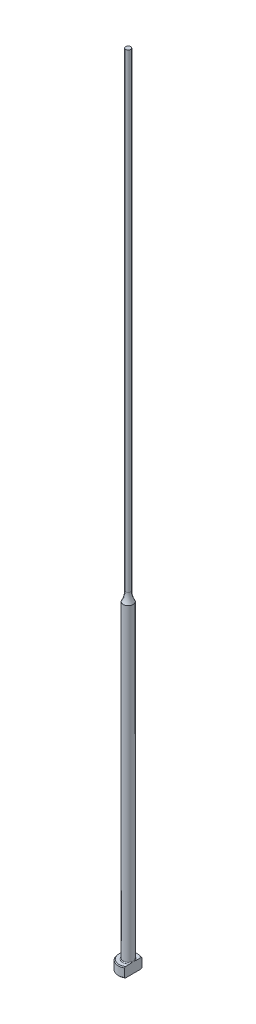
ISO-10303-21;
HEADER;
FILE_DESCRIPTION(('STEP AP214'),'2;1');
FILE_NAME('part.step','',(''),(''),'','','');
FILE_SCHEMA(('AUTOMOTIVE_DESIGN { 1 0 10303 214 1 1 1 1 }'));
ENDSEC;
DATA;
#1=APPLICATION_CONTEXT('core data for automotive mechanical design processes');
#2=APPLICATION_PROTOCOL_DEFINITION('international standard','automotive_design',2000,#1);
#3=PRODUCT_CONTEXT('',#1,'mechanical');
#4=PRODUCT('Part','Part','',(#3));
#5=PRODUCT_RELATED_PRODUCT_CATEGORY('part','',(#4));
#6=PRODUCT_DEFINITION_FORMATION('','',#4);
#7=PRODUCT_DEFINITION_CONTEXT('part definition',#1,'design');
#8=PRODUCT_DEFINITION('design','',#6,#7);
#9=PRODUCT_DEFINITION_SHAPE('','',#8);
#10=(LENGTH_UNIT() NAMED_UNIT(*) SI_UNIT(.MILLI.,.METRE.));
#11=(NAMED_UNIT(*) PLANE_ANGLE_UNIT() SI_UNIT($,.RADIAN.));
#12=(NAMED_UNIT(*) SI_UNIT($,.STERADIAN.) SOLID_ANGLE_UNIT());
#13=UNCERTAINTY_MEASURE_WITH_UNIT(LENGTH_MEASURE(1.E-05),#10,'distance_accuracy_value','');
#14=(GEOMETRIC_REPRESENTATION_CONTEXT(3) GLOBAL_UNCERTAINTY_ASSIGNED_CONTEXT((#13)) GLOBAL_UNIT_ASSIGNED_CONTEXT((#10,
#11,#12)) REPRESENTATION_CONTEXT('',''));
#15=CARTESIAN_POINT('',(0.,0.,0.));
#16=DIRECTION('',(0.,0.,1.));
#17=DIRECTION('',(1.,0.,0.));
#18=AXIS2_PLACEMENT_3D('',#15,#16,#17);
#19=CARTESIAN_POINT('',(-3.17499999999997,3.175,0.));
#20=DIRECTION('',(0.,1.,0.));
#21=DIRECTION('',(0.,0.,1.));
#22=AXIS2_PLACEMENT_3D('',#19,#20,#21);
#23=PLANE('',#22);
#24=CARTESIAN_POINT('',(0.,3.175,0.));
#25=DIRECTION('',(0.,1.,0.));
#26=DIRECTION('',(0.,0.,1.));
#27=AXIS2_PLACEMENT_3D('',#24,#25,#26);
#28=CIRCLE('',#27,2.92099999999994);
#29=CARTESIAN_POINT('',(1.58749999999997,3.175,-2.45195529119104));
#30=VERTEX_POINT('',#29);
#31=CARTESIAN_POINT('',(1.58749999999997,3.175,2.45195529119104));
#32=VERTEX_POINT('',#31);
#33=EDGE_CURVE('E105',#30,#32,#28,.T.);
#34=ORIENTED_EDGE('',*,*,#33,.T.);
#35=DIRECTION('',(0.,0.,1.));
#36=VECTOR('',#35,1.);
#37=CARTESIAN_POINT('',(1.58749999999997,3.17499999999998,2.74963065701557));
#38=LINE('',#37,#36);
#39=CARTESIAN_POINT('',(1.58749999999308,3.175,0.933255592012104));
#40=VERTEX_POINT('',#39);
#41=EDGE_CURVE('E126',#40,#32,#38,.T.);
#42=ORIENTED_EDGE('',*,*,#41,.F.);
#43=CARTESIAN_POINT('',(0.,3.175,0.));
#44=DIRECTION('',(0.,1.,0.));
#45=DIRECTION('',(0.,0.,1.));
#46=AXIS2_PLACEMENT_3D('',#43,#44,#45);
#47=CIRCLE('',#46,1.84149999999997);
#48=CARTESIAN_POINT('',(1.58749999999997,3.17500000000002,-0.933255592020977));
#49=VERTEX_POINT('',#48);
#50=EDGE_CURVE('E11',#40,#49,#47,.F.);
#51=ORIENTED_EDGE('',*,*,#50,.T.);
#52=EDGE_CURVE('E52',#30,#49,#38,.T.);
#53=ORIENTED_EDGE('',*,*,#52,.F.);
#54=EDGE_LOOP('',(#34,#42,#51,#53));
#55=FACE_BOUND('',#54,.T.);
#56=ADVANCED_FACE('F32',(#55),#23,.T.);
#57=CARTESIAN_POINT('',(0.,259.958771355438,0.));
#58=DIRECTION('',(0.,1.,0.));
#59=DIRECTION('',(0.,0.,1.));
#60=AXIS2_PLACEMENT_3D('',#57,#58,#59);
#61=CYLINDRICAL_SURFACE('',#60,3.17499999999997);
#62=CARTESIAN_POINT('',(0.,2.92100000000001,0.));
#63=DIRECTION('',(0.,1.,0.));
#64=DIRECTION('',(0.,0.,1.));
#65=AXIS2_PLACEMENT_3D('',#62,#63,#64);
#66=CIRCLE('',#65,3.17499999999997);
#67=CARTESIAN_POINT('',(1.58749999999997,2.92100000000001,2.74963065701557));
#68=VERTEX_POINT('',#67);
#69=CARTESIAN_POINT('',(1.58749999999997,2.92100000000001,-2.74963065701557));
#70=VERTEX_POINT('',#69);
#71=EDGE_CURVE('E98',#68,#70,#66,.F.);
#72=ORIENTED_EDGE('',*,*,#71,.T.);
#73=DIRECTION('',(0.,-1.,0.));
#74=VECTOR('',#73,1.);
#75=CARTESIAN_POINT('',(1.58749999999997,254.001,-2.74963065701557));
#76=LINE('',#75,#74);
#77=CARTESIAN_POINT('',(1.58749999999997,0.253999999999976,-2.74963065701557));
#78=VERTEX_POINT('',#77);
#79=EDGE_CURVE('E141',#70,#78,#76,.T.);
#80=ORIENTED_EDGE('',*,*,#79,.T.);
#81=CARTESIAN_POINT('',(0.,0.253999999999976,0.));
#82=DIRECTION('',(0.,-1.,0.));
#83=DIRECTION('',(0.,0.,-1.));
#84=AXIS2_PLACEMENT_3D('',#81,#82,#83);
#85=CIRCLE('',#84,3.17499999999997);
#86=CARTESIAN_POINT('',(1.58749999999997,0.253999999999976,2.74963065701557));
#87=VERTEX_POINT('',#86);
#88=EDGE_CURVE('E95',#78,#87,#85,.F.);
#89=ORIENTED_EDGE('',*,*,#88,.T.);
#90=DIRECTION('',(0.,-1.,0.));
#91=VECTOR('',#90,1.);
#92=CARTESIAN_POINT('',(1.58749999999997,254.001,2.74963065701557));
#93=LINE('',#92,#91);
#94=EDGE_CURVE('E88',#68,#87,#93,.T.);
#95=ORIENTED_EDGE('',*,*,#94,.F.);
#96=EDGE_LOOP('',(#72,#80,#89,#95));
#97=FACE_BOUND('',#96,.T.);
#98=ADVANCED_FACE('F191',(#97),#61,.T.);
#99=CARTESIAN_POINT('',(0.,0.,0.));
#100=DIRECTION('',(0.,-1.,0.));
#101=DIRECTION('',(0.,0.,-1.));
#102=AXIS2_PLACEMENT_3D('',#99,#100,#101);
#103=PLANE('',#102);
#104=CARTESIAN_POINT('',(0.,0.,0.));
#105=DIRECTION('',(0.,-1.,0.));
#106=DIRECTION('',(0.,0.,-1.));
#107=AXIS2_PLACEMENT_3D('',#104,#105,#106);
#108=CIRCLE('',#107,2.92100000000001);
#109=CARTESIAN_POINT('',(1.58749999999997,0.,2.45195529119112));
#110=VERTEX_POINT('',#109);
#111=CARTESIAN_POINT('',(1.58749999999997,0.,-2.45195529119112));
#112=VERTEX_POINT('',#111);
#113=EDGE_CURVE('E93',#110,#112,#108,.T.);
#114=ORIENTED_EDGE('',*,*,#113,.T.);
#115=DIRECTION('',(0.,0.,1.));
#116=VECTOR('',#115,1.);
#117=CARTESIAN_POINT('',(1.58749999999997,0.,2.74963065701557));
#118=LINE('',#117,#116);
#119=EDGE_CURVE('E78',#112,#110,#118,.T.);
#120=ORIENTED_EDGE('',*,*,#119,.T.);
#121=EDGE_LOOP('',(#114,#120));
#122=FACE_BOUND('',#121,.T.);
#123=ADVANCED_FACE('F97',(#122),#103,.T.);
#124=CARTESIAN_POINT('',(0.,3.17499999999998,0.));
#125=DIRECTION('',(0.,-1.,0.));
#126=DIRECTION('',(0.,0.,-1.));
#127=AXIS2_PLACEMENT_3D('',#124,#125,#126);
#128=CONICAL_SURFACE('',#127,2.92099999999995,0.785398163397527);
#129=ORIENTED_EDGE('',*,*,#71,.F.);
#130=CARTESIAN_POINT('',(1.58749999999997,-0.16162066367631,-6.0529050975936));
#131=CARTESIAN_POINT('',(1.58749999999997,-0.0288893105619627,-5.91567682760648));
#132=CARTESIAN_POINT('',(1.58749999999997,0.103699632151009,-5.7783103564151));
#133=CARTESIAN_POINT('',(1.58749999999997,0.368508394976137,-5.50321874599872));
#134=CARTESIAN_POINT('',(1.58749999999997,0.500728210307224,-5.36549360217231));
#135=CARTESIAN_POINT('',(1.58749999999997,0.764778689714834,-5.08953516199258));
#136=CARTESIAN_POINT('',(1.58749999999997,0.896609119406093,-4.9513016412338));
#137=CARTESIAN_POINT('',(1.58749999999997,1.15968706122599,-4.67428233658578));
#138=CARTESIAN_POINT('',(1.58749999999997,1.29093457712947,-4.53549655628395));
#139=CARTESIAN_POINT('',(1.58749999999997,1.55007705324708,-4.25997724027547));
#140=CARTESIAN_POINT('',(1.58749999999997,1.67798684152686,-4.12325766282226));
#141=CARTESIAN_POINT('',(1.58749999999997,1.9328486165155,-3.84892898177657));
#142=CARTESIAN_POINT('',(1.58749999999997,2.05980060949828,-3.71131988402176));
#143=CARTESIAN_POINT('',(1.58749999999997,2.31237508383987,-3.43493978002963));
#144=CARTESIAN_POINT('',(1.58749999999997,2.43799784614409,-3.29616903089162));
#145=CARTESIAN_POINT('',(1.58749999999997,2.68741369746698,-3.01699558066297));
#146=CARTESIAN_POINT('',(1.58749999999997,2.81120686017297,-2.8765929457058));
#147=CARTESIAN_POINT('',(1.58749999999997,3.00875865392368,-2.64816703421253));
#148=CARTESIAN_POINT('',(1.58749999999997,3.08336151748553,-2.56087478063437));
#149=CARTESIAN_POINT('',(1.58749999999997,3.2312387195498,-2.38515423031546));
#150=CARTESIAN_POINT('',(1.58749999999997,3.30451292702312,-2.29672582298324));
#151=CARTESIAN_POINT('',(1.58749999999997,3.45004422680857,-2.1174740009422));
#152=CARTESIAN_POINT('',(1.58749999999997,3.5222823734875,-2.02663514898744));
#153=CARTESIAN_POINT('',(1.58749999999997,3.66423097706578,-1.8430252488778));
#154=CARTESIAN_POINT('',(1.58749999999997,3.73394203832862,-1.75025467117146));
#155=CARTESIAN_POINT('',(1.58749999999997,3.87080633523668,-1.5606747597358));
#156=CARTESIAN_POINT('',(1.58749999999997,3.93790459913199,-1.46382547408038));
#157=CARTESIAN_POINT('',(1.58749999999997,4.06669147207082,-1.26632594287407));
#158=CARTESIAN_POINT('',(1.58749999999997,4.1283726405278,-1.16567073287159));
#159=CARTESIAN_POINT('',(1.58749999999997,4.21402252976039,-1.01165766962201));
#160=CARTESIAN_POINT('',(1.58749999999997,4.24127929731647,-0.960142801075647));
#161=CARTESIAN_POINT('',(1.58749999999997,4.2930979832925,-0.855780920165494));
#162=CARTESIAN_POINT('',(1.58749999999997,4.31765941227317,-0.802933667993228));
#163=CARTESIAN_POINT('',(1.58749999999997,4.38614656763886,-0.642461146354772));
#164=CARTESIAN_POINT('',(1.58749999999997,4.42510149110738,-0.532518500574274));
#165=CARTESIAN_POINT('',(1.58749999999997,4.46726244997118,-0.367680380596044));
#166=CARTESIAN_POINT('',(1.58749999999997,4.47844427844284,-0.314802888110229));
#167=CARTESIAN_POINT('',(1.58749999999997,4.49576654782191,-0.208209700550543));
#168=CARTESIAN_POINT('',(1.58749999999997,4.50190743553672,-0.154494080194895));
#169=CARTESIAN_POINT('',(1.58749999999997,4.50871296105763,-0.0468792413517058));
#170=CARTESIAN_POINT('',(1.58749999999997,4.5093945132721,0.00701889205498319));
#171=CARTESIAN_POINT('',(1.58749999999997,4.50527679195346,0.114606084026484));
#172=CARTESIAN_POINT('',(1.58749999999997,4.50047706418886,0.168295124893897));
#173=CARTESIAN_POINT('',(1.58749999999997,4.48579689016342,0.27448544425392));
#174=CARTESIAN_POINT('',(1.58749999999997,4.47596081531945,0.32699298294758));
#175=CARTESIAN_POINT('',(1.58749999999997,4.45181809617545,0.430974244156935));
#176=CARTESIAN_POINT('',(1.58749999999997,4.4375096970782,0.482447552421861));
#177=CARTESIAN_POINT('',(1.58749999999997,4.40502489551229,0.584460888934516));
#178=CARTESIAN_POINT('',(1.58749999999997,4.386827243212,0.634994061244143));
#179=CARTESIAN_POINT('',(1.58749999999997,4.34729308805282,0.734789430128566));
#180=CARTESIAN_POINT('',(1.58749999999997,4.3259572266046,0.784051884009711));
#181=CARTESIAN_POINT('',(1.58749999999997,4.25791922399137,0.930549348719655));
#182=CARTESIAN_POINT('',(1.58749999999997,4.20736047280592,1.0259880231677));
#183=CARTESIAN_POINT('',(1.58749999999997,4.0995545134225,1.21304313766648));
#184=CARTESIAN_POINT('',(1.58749999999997,4.04229912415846,1.30465471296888));
#185=CARTESIAN_POINT('',(1.58749999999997,3.92308746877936,1.48526211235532));
#186=CARTESIAN_POINT('',(1.58749999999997,3.86111349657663,1.57424615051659));
#187=CARTESIAN_POINT('',(1.58749999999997,3.73408621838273,1.74990003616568));
#188=CARTESIAN_POINT('',(1.58749999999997,3.66903444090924,1.83657099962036));
#189=CARTESIAN_POINT('',(1.58749999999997,3.53583371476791,2.00931764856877));
#190=CARTESIAN_POINT('',(1.58749999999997,3.46765527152,2.09537048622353));
#191=CARTESIAN_POINT('',(1.58749999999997,3.32960643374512,2.26611736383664));
#192=CARTESIAN_POINT('',(1.58749999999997,3.25973586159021,2.35081125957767));
#193=CARTESIAN_POINT('',(1.58749999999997,3.04858139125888,2.60290121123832));
#194=CARTESIAN_POINT('',(1.58749999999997,2.90542388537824,2.76872537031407));
#195=CARTESIAN_POINT('',(1.58749999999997,2.64069522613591,3.06970913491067));
#196=CARTESIAN_POINT('',(1.58749999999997,2.51959458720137,3.20528660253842));
#197=CARTESIAN_POINT('',(1.58749999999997,2.27590400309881,3.47510321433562));
#198=CARTESIAN_POINT('',(1.58749999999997,2.15331401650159,3.60934232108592));
#199=CARTESIAN_POINT('',(1.58749999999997,1.90694239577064,3.87695374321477));
#200=CARTESIAN_POINT('',(1.58749999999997,1.78315974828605,4.0103251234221));
#201=CARTESIAN_POINT('',(1.58749999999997,1.53478104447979,4.27630880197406));
#202=CARTESIAN_POINT('',(1.58749999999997,1.41018498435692,4.40892109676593));
#203=CARTESIAN_POINT('',(1.58749999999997,1.0457468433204,4.79499418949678));
#204=CARTESIAN_POINT('',(1.58749999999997,0.80507680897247,5.04767313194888));
#205=CARTESIAN_POINT('',(1.58749999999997,0.443121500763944,5.42550911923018));
#206=CARTESIAN_POINT('',(1.58749999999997,0.322378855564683,5.55118772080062));
#207=CARTESIAN_POINT('',(1.58749999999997,0.0805914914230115,5.80225207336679));
#208=CARTESIAN_POINT('',(1.58749999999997,-0.040453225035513,5.92763782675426));
#209=CARTESIAN_POINT('',(1.58749999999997,-0.161620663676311,6.0529050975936));
#210=B_SPLINE_CURVE_WITH_KNOTS('',3,(#130,#131,#132,#133,#134,#135,#136,#137,#138,#139,#140,
#141,#142,#143,#144,#145,#146,#147,#148,#149,#150,#151,#152,#153,#154,#155,#156,#157,#158,#159,
#160,#161,#162,#163,#164,#165,#166,#167,#168,#169,#170,#171,#172,#173,#174,#175,#176,#177,#178,
#179,#180,#181,#182,#183,#184,#185,#186,#187,#188,#189,#190,#191,#192,#193,#194,#195,#196,#197,
#198,#199,#200,#201,#202,#203,#204,#205,#206,#207,#208,#209),.UNSPECIFIED.,.F.,.F.,(4,2,2,2,2,2,
2,2,2,2,2,2,2,2,2,2,2,2,2,2,2,2,2,2,2,2,2,2,2,2,2,2,2,2,2,2,2,2,2,4),(0.,0.572750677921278,
1.14550874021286,1.71856057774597,2.29160869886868,2.85328006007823,3.4149477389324,
3.97649423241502,4.53801804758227,4.88249307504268,5.22700189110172,5.5751532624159,
5.92322081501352,6.27657800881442,6.63041319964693,6.80518126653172,6.9799810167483,
7.3282426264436,7.49018491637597,7.65211285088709,7.81353889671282,7.97497832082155,
8.13501929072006,8.29512313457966,8.45612518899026,8.61709438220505,8.94062993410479,
9.2645649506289,9.58978187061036,9.91483894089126,10.2441741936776,10.5735441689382,
11.2306812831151,11.7760337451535,12.3214014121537,12.8672825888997,13.4131663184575,
14.4600164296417,14.9828595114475,15.5056983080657),.UNSPECIFIED.);
#211=EDGE_CURVE('E118',#32,#68,#210,.T.);
#212=ORIENTED_EDGE('',*,*,#211,.F.);
#213=ORIENTED_EDGE('',*,*,#33,.F.);
#214=EDGE_CURVE('E117',#70,#30,#210,.T.);
#215=ORIENTED_EDGE('',*,*,#214,.F.);
#216=EDGE_LOOP('',(#129,#212,#213,#215));
#217=FACE_BOUND('',#216,.T.);
#218=ADVANCED_FACE('F162',(#217),#128,.T.);
#219=CARTESIAN_POINT('',(0.,0.253999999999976,0.));
#220=DIRECTION('',(0.,1.,0.));
#221=DIRECTION('',(0.,0.,1.));
#222=AXIS2_PLACEMENT_3D('',#219,#220,#221);
#223=CONICAL_SURFACE('',#222,3.17499999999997,0.785398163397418);
#224=ORIENTED_EDGE('',*,*,#88,.F.);
#225=CARTESIAN_POINT('',(1.58749999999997,3.33662066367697,6.0529050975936));
#226=CARTESIAN_POINT('',(1.58749999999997,3.20388931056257,5.91567682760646));
#227=CARTESIAN_POINT('',(1.58749999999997,3.07130036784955,5.77831035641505));
#228=CARTESIAN_POINT('',(1.58749999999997,2.80649160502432,5.50321874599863));
#229=CARTESIAN_POINT('',(1.58749999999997,2.67427178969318,5.3654936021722));
#230=CARTESIAN_POINT('',(1.58749999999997,2.41022131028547,5.08953516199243));
#231=CARTESIAN_POINT('',(1.58749999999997,2.27839088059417,4.95130164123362));
#232=CARTESIAN_POINT('',(1.58749999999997,2.01531293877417,4.67428233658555));
#233=CARTESIAN_POINT('',(1.58749999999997,1.88406542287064,4.5354965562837));
#234=CARTESIAN_POINT('',(1.58749999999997,1.62492294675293,4.25997724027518));
#235=CARTESIAN_POINT('',(1.58749999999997,1.49701315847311,4.12325766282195));
#236=CARTESIAN_POINT('',(1.58749999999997,1.24215138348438,3.84892898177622));
#237=CARTESIAN_POINT('',(1.58749999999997,1.11519939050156,3.71131988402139));
#238=CARTESIAN_POINT('',(1.58749999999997,0.862624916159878,3.43493978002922));
#239=CARTESIAN_POINT('',(1.58749999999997,0.737002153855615,3.29616903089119));
#240=CARTESIAN_POINT('',(1.58749999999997,0.487586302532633,3.01699558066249));
#241=CARTESIAN_POINT('',(1.58749999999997,0.363793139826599,2.8765929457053));
#242=CARTESIAN_POINT('',(1.58749999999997,0.166241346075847,2.64816703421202));
#243=CARTESIAN_POINT('',(1.58749999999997,0.0916384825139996,2.56087478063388));
#244=CARTESIAN_POINT('',(1.58749999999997,-0.0562387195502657,2.385154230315));
#245=CARTESIAN_POINT('',(1.58749999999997,-0.129512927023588,2.29672582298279));
#246=CARTESIAN_POINT('',(1.58749999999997,-0.27504422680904,2.11747400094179));
#247=CARTESIAN_POINT('',(1.58749999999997,-0.347282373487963,2.02663514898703));
#248=CARTESIAN_POINT('',(1.58749999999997,-0.489230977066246,1.84302524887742));
#249=CARTESIAN_POINT('',(1.58749999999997,-0.558942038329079,1.7502546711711));
#250=CARTESIAN_POINT('',(1.58749999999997,-0.695806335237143,1.56067475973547));
#251=CARTESIAN_POINT('',(1.58749999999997,-0.762904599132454,1.46382547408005));
#252=CARTESIAN_POINT('',(1.58749999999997,-0.891691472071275,1.26632594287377));
#253=CARTESIAN_POINT('',(1.58749999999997,-0.953372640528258,1.16567073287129));
#254=CARTESIAN_POINT('',(1.58749999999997,-1.03902252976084,1.01165766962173));
#255=CARTESIAN_POINT('',(1.58749999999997,-1.06627929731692,0.960142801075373));
#256=CARTESIAN_POINT('',(1.58749999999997,-1.11809798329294,0.85578092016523));
#257=CARTESIAN_POINT('',(1.58749999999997,-1.14265941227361,0.802933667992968));
#258=CARTESIAN_POINT('',(1.58749999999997,-1.21114656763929,0.642461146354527));
#259=CARTESIAN_POINT('',(1.58749999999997,-1.2501014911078,0.532518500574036));
#260=CARTESIAN_POINT('',(1.58749999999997,-1.29226244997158,0.367680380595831));
#261=CARTESIAN_POINT('',(1.58749999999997,-1.30344427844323,0.314802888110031));
#262=CARTESIAN_POINT('',(1.58749999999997,-1.32076654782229,0.208209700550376));
#263=CARTESIAN_POINT('',(1.58749999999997,-1.3269074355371,0.154494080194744));
#264=CARTESIAN_POINT('',(1.58749999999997,-1.333712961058,0.0468792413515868));
#265=CARTESIAN_POINT('',(1.58749999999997,-1.33439451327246,-0.00701889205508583));
#266=CARTESIAN_POINT('',(1.58749999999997,-1.33027679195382,-0.114606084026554));
#267=CARTESIAN_POINT('',(1.58749999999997,-1.32547706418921,-0.168295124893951));
#268=CARTESIAN_POINT('',(1.58749999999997,-1.31079689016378,-0.274485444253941));
#269=CARTESIAN_POINT('',(1.58749999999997,-1.3009608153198,-0.326992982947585));
#270=CARTESIAN_POINT('',(1.58749999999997,-1.27681809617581,-0.430974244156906));
#271=CARTESIAN_POINT('',(1.58749999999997,-1.26250969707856,-0.482447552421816));
#272=CARTESIAN_POINT('',(1.58749999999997,-1.23002489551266,-0.584460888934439));
#273=CARTESIAN_POINT('',(1.58749999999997,-1.21182724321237,-0.634994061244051));
#274=CARTESIAN_POINT('',(1.58749999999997,-1.1722930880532,-0.734789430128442));
#275=CARTESIAN_POINT('',(1.58749999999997,-1.15095722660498,-0.784051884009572));
#276=CARTESIAN_POINT('',(1.58749999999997,-1.08291922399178,-0.93054934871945));
#277=CARTESIAN_POINT('',(1.58749999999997,-1.03236047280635,-1.02598802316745));
#278=CARTESIAN_POINT('',(1.58749999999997,-0.924554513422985,-1.21304313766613));
#279=CARTESIAN_POINT('',(1.58749999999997,-0.86729912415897,-1.30465471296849));
#280=CARTESIAN_POINT('',(1.58749999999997,-0.748087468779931,-1.48526211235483));
#281=CARTESIAN_POINT('',(1.58749999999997,-0.686113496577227,-1.57424615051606));
#282=CARTESIAN_POINT('',(1.58749999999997,-0.55908621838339,-1.74990003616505));
#283=CARTESIAN_POINT('',(1.58749999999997,-0.494034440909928,-1.83657099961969));
#284=CARTESIAN_POINT('',(1.58749999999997,-0.360833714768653,-2.00931764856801));
#285=CARTESIAN_POINT('',(1.58749999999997,-0.292655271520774,-2.09537048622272));
#286=CARTESIAN_POINT('',(1.58749999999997,-0.154606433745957,-2.26611736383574));
#287=CARTESIAN_POINT('',(1.58749999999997,-0.0847358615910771,-2.35081125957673));
#288=CARTESIAN_POINT('',(1.58749999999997,0.126418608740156,-2.60290121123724));
#289=CARTESIAN_POINT('',(1.58749999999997,0.269576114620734,-2.76872537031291));
#290=CARTESIAN_POINT('',(1.58749999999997,0.534304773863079,-3.06970913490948));
#291=CARTESIAN_POINT('',(1.58749999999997,0.655405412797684,-3.20528660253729));
#292=CARTESIAN_POINT('',(1.58749999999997,0.899095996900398,-3.47510321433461));
#293=CARTESIAN_POINT('',(1.58749999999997,1.02168598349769,-3.60934232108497));
#294=CARTESIAN_POINT('',(1.58749999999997,1.26805760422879,-3.87695374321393));
#295=CARTESIAN_POINT('',(1.58749999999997,1.39184025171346,-4.01032512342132));
#296=CARTESIAN_POINT('',(1.58749999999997,1.64021895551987,-4.2763088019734));
#297=CARTESIAN_POINT('',(1.58749999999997,1.76481501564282,-4.40892109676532));
#298=CARTESIAN_POINT('',(1.58749999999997,2.12925315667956,-4.79499418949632));
#299=CARTESIAN_POINT('',(1.58749999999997,2.36992319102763,-5.04767313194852));
#300=CARTESIAN_POINT('',(1.58749999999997,2.73187849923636,-5.42550911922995));
#301=CARTESIAN_POINT('',(1.58749999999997,2.85262114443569,-5.55118772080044));
#302=CARTESIAN_POINT('',(1.58749999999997,3.09440850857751,-5.8022520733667));
#303=CARTESIAN_POINT('',(1.58749999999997,3.2154532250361,-5.92763782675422));
#304=CARTESIAN_POINT('',(1.58749999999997,3.33662066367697,-6.0529050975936));
#305=B_SPLINE_CURVE_WITH_KNOTS('',3,(#225,#226,#227,#228,#229,#230,#231,#232,#233,#234,#235,
#236,#237,#238,#239,#240,#241,#242,#243,#244,#245,#246,#247,#248,#249,#250,#251,#252,#253,#254,
#255,#256,#257,#258,#259,#260,#261,#262,#263,#264,#265,#266,#267,#268,#269,#270,#271,#272,#273,
#274,#275,#276,#277,#278,#279,#280,#281,#282,#283,#284,#285,#286,#287,#288,#289,#290,#291,#292,
#293,#294,#295,#296,#297,#298,#299,#300,#301,#302,#303,#304),.UNSPECIFIED.,.F.,.F.,(4,2,2,2,2,2,
2,2,2,2,2,2,2,2,2,2,2,2,2,2,2,2,2,2,2,2,2,2,2,2,2,2,2,2,2,2,2,2,2,4),(0.,0.57275067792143,
1.14550874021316,1.71856057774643,2.29160869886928,2.85328006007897,3.41494773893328,
3.97649423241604,4.53801804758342,4.88249307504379,5.2270018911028,5.57515326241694,
5.92322081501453,6.27657800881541,6.63041319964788,6.80518126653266,6.97998101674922,
7.32824262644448,7.49018491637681,7.65211285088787,7.81353889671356,7.97497832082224,
8.1350192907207,8.29512313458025,8.45612518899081,8.61709438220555,8.94062993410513,
9.26456495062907,9.58978187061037,9.91483894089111,10.2441741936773,10.5735441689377,
11.2306812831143,11.776033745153,12.3214014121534,12.8672825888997,13.4131663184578,
14.4600164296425,14.9828595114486,15.505698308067),.UNSPECIFIED.);
#306=EDGE_CURVE('E81',#112,#78,#305,.T.);
#307=ORIENTED_EDGE('',*,*,#306,.F.);
#308=ORIENTED_EDGE('',*,*,#113,.F.);
#309=EDGE_CURVE('E84',#87,#110,#305,.T.);
#310=ORIENTED_EDGE('',*,*,#309,.F.);
#311=EDGE_LOOP('',(#224,#307,#308,#310));
#312=FACE_BOUND('',#311,.T.);
#313=ADVANCED_FACE('F92',(#312),#223,.T.);
#314=CARTESIAN_POINT('',(0.,3.42900000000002,0.));
#315=DIRECTION('',(0.,1.,0.));
#316=DIRECTION('',(0.,0.,1.));
#317=AXIS2_PLACEMENT_3D('',#314,#315,#316);
#318=TOROIDAL_SURFACE('',#317,1.84149999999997,0.254);
#319=CARTESIAN_POINT('',(1.58749999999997,3.42900000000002,0.));
#320=CARTESIAN_POINT('',(1.58749999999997,3.42899942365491,-1.9220514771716E-10));
#321=CARTESIAN_POINT('',(1.58749999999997,3.42899884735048,-1.2261161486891E-07));
#322=CARTESIAN_POINT('',(1.58749999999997,3.42899773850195,-5.09676365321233E-07));
#323=CARTESIAN_POINT('',(1.58749999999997,3.42899720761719,-7.78176328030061E-07));
#324=CARTESIAN_POINT('',(1.58749999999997,3.42899614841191,-1.42307272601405E-06));
#325=CARTESIAN_POINT('',(1.58749999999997,3.42899562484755,-1.80713867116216E-06));
#326=CARTESIAN_POINT('',(1.58749999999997,3.42899463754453,-2.63494846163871E-06));
#327=CARTESIAN_POINT('',(1.58749999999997,3.42899417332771,-3.07814756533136E-06));
#328=CARTESIAN_POINT('',(1.58749999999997,3.42899261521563,-4.66897357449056E-06));
#329=CARTESIAN_POINT('',(1.58749999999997,3.42899159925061,-5.89404908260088E-06));
#330=CARTESIAN_POINT('',(1.58749999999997,3.42898979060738,-8.42427511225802E-06));
#331=CARTESIAN_POINT('',(1.58749999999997,3.42898899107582,-9.7248057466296E-06));
#332=CARTESIAN_POINT('',(1.58749999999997,3.42898598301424,-1.48060601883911E-05));
#333=CARTESIAN_POINT('',(1.58749999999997,3.42898393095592,-1.86838281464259E-05));
#334=CARTESIAN_POINT('',(1.58749999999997,3.42898057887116,-2.63261117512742E-05));
#335=CARTESIAN_POINT('',(1.58749999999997,3.42897922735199,-3.00687417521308E-05));
#336=CARTESIAN_POINT('',(1.58749999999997,3.42897347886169,-4.60276298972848E-05));
#337=CARTESIAN_POINT('',(1.58749999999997,3.42896911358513,-5.8247019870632E-05));
#338=CARTESIAN_POINT('',(1.58749999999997,3.42896211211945,-8.11070097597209E-05));
#339=CARTESIAN_POINT('',(1.58749999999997,3.42895931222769,-9.16953114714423E-05));
#340=CARTESIAN_POINT('',(1.58749999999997,3.42893712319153,-0.000168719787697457));
#341=CARTESIAN_POINT('',(1.58749999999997,3.42890881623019,-0.000232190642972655));
#342=CARTESIAN_POINT('',(1.58749999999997,3.42880276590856,-0.000479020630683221));
#343=CARTESIAN_POINT('',(1.58749999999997,3.42873165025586,-0.00066443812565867));
#344=CARTESIAN_POINT('',(1.58749999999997,3.42845137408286,-0.0013844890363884));
#345=CARTESIAN_POINT('',(1.58749999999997,3.42823526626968,-0.00191701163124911));
#346=CARTESIAN_POINT('',(1.58749999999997,3.42735449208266,-0.00409774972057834));
#347=CARTESIAN_POINT('',(1.58749999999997,3.42669768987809,-0.00574830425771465));
#348=CARTESIAN_POINT('',(1.58749999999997,3.4174405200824,-0.0289985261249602));
#349=CARTESIAN_POINT('',(1.58749999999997,3.40878325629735,-0.0505816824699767));
#350=CARTESIAN_POINT('',(1.58749999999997,3.39189297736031,-0.0929947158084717));
#351=CARTESIAN_POINT('',(1.58749999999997,3.38365605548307,-0.11382315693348));
#352=CARTESIAN_POINT('',(1.58749999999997,3.36635393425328,-0.157956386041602));
#353=CARTESIAN_POINT('',(1.58749999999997,3.35730391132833,-0.181267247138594));
#354=CARTESIAN_POINT('',(1.58749999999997,3.33936775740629,-0.228222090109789));
#355=CARTESIAN_POINT('',(1.58749999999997,3.33048420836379,-0.25186705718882));
#356=CARTESIAN_POINT('',(1.58749999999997,3.30894496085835,-0.310512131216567));
#357=CARTESIAN_POINT('',(1.58749999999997,3.29649449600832,-0.345588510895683));
#358=CARTESIAN_POINT('',(1.58749999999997,3.27296975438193,-0.415278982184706));
#359=CARTESIAN_POINT('',(1.58749999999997,3.26186987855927,-0.449884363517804));
#360=CARTESIAN_POINT('',(1.58749999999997,3.2395832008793,-0.524471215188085));
#361=CARTESIAN_POINT('',(1.58749999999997,3.22860862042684,-0.564517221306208));
#362=CARTESIAN_POINT('',(1.58749999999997,3.20902534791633,-0.645529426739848));
#363=CARTESIAN_POINT('',(1.58749999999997,3.20043582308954,-0.686500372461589));
#364=CARTESIAN_POINT('',(1.58749999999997,3.18611712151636,-0.771546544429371));
#365=CARTESIAN_POINT('',(1.58749999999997,3.18059550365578,-0.815658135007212));
#366=CARTESIAN_POINT('',(1.58749999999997,3.17455396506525,-0.904117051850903));
#367=CARTESIAN_POINT('',(1.58749999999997,3.17401361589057,-0.948462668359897));
#368=CARTESIAN_POINT('',(1.58749999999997,3.17898948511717,-1.02531896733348));
#369=CARTESIAN_POINT('',(1.58749999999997,3.1829739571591,-1.05792141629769));
#370=CARTESIAN_POINT('',(1.58749999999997,3.19569167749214,-1.12184393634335));
#371=CARTESIAN_POINT('',(1.58749999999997,3.20436049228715,-1.1531753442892));
#372=CARTESIAN_POINT('',(1.58749999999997,3.22236152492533,-1.19946468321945));
#373=CARTESIAN_POINT('',(1.58749999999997,3.2295150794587,-1.21526783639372));
#374=CARTESIAN_POINT('',(1.58749999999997,3.24587062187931,-1.24583726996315));
#375=CARTESIAN_POINT('',(1.58749999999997,3.25507530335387,-1.26060215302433));
#376=CARTESIAN_POINT('',(1.58749999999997,3.27378481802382,-1.28575815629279));
#377=CARTESIAN_POINT('',(1.58749999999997,3.28289001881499,-1.29644383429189));
#378=CARTESIAN_POINT('',(1.58749999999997,3.30268460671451,-1.31623154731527));
#379=CARTESIAN_POINT('',(1.58749999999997,3.31337067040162,-1.32533681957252));
#380=CARTESIAN_POINT('',(1.58749999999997,3.33349977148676,-1.33941140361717));
#381=CARTESIAN_POINT('',(1.58749999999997,3.34261446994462,-1.34484814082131));
#382=CARTESIAN_POINT('',(1.58749999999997,3.36161455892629,-1.35416329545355));
#383=CARTESIAN_POINT('',(1.58749999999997,3.37149946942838,-1.35804267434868));
#384=CARTESIAN_POINT('',(1.58749999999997,3.39188678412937,-1.36398436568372));
#385=CARTESIAN_POINT('',(1.58749999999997,3.40239309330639,-1.36603350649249));
#386=CARTESIAN_POINT('',(1.58749999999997,3.42360372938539,-1.3680840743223));
#387=CARTESIAN_POINT('',(1.58749999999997,3.43430795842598,-1.36808648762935));
#388=CARTESIAN_POINT('',(1.58749999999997,3.45433283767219,-1.36616208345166));
#389=CARTESIAN_POINT('',(1.58749999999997,3.46367506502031,-1.36444960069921));
#390=CARTESIAN_POINT('',(1.58749999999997,3.48195519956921,-1.35953338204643));
#391=CARTESIAN_POINT('',(1.58749999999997,3.49089304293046,-1.3563294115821));
#392=CARTESIAN_POINT('',(1.58749999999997,3.50850302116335,-1.34848006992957));
#393=CARTESIAN_POINT('',(1.58749999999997,3.5171531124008,-1.34378578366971));
#394=CARTESIAN_POINT('',(1.58749999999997,3.53371257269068,-1.33324445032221));
#395=CARTESIAN_POINT('',(1.58749999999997,3.54162163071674,-1.32739692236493));
#396=CARTESIAN_POINT('',(1.58749999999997,3.56107121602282,-1.31107304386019));
#397=CARTESIAN_POINT('',(1.58749999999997,3.57202221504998,-1.29989286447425));
#398=CARTESIAN_POINT('',(1.58749999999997,3.59202509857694,-1.27593566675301));
#399=CARTESIAN_POINT('',(1.58749999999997,3.60107086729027,-1.26315370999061));
#400=CARTESIAN_POINT('',(1.58749999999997,3.62186023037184,-1.22930733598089));
#401=CARTESIAN_POINT('',(1.58749999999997,3.63240584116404,-1.20751096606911));
#402=CARTESIAN_POINT('',(1.58749999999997,3.65004643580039,-1.16266144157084));
#403=CARTESIAN_POINT('',(1.58749999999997,3.65714435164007,-1.13960937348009));
#404=CARTESIAN_POINT('',(1.58749999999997,3.67265428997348,-1.07603916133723));
#405=CARTESIAN_POINT('',(1.58749999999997,3.67834921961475,-1.03486686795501));
#406=CARTESIAN_POINT('',(1.58749999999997,3.68382880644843,-0.951558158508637));
#407=CARTESIAN_POINT('',(1.58749999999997,3.68350976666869,-0.909417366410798));
#408=CARTESIAN_POINT('',(1.58749999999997,3.67745397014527,-0.811383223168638));
#409=CARTESIAN_POINT('',(1.58749999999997,3.66993873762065,-0.755610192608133));
#410=CARTESIAN_POINT('',(1.58749999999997,3.64933373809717,-0.644937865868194));
#411=CARTESIAN_POINT('',(1.58749999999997,3.63621897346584,-0.59004364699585));
#412=CARTESIAN_POINT('',(1.58749999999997,3.60740922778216,-0.485757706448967));
#413=CARTESIAN_POINT('',(1.58749999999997,3.59201096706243,-0.436281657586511));
#414=CARTESIAN_POINT('',(1.58749999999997,3.55922497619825,-0.338551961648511));
#415=CARTESIAN_POINT('',(1.58749999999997,3.5418584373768,-0.290291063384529));
#416=CARTESIAN_POINT('',(1.58749999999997,3.51760237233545,-0.225557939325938));
#417=CARTESIAN_POINT('',(1.58749999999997,3.51126413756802,-0.208874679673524));
#418=CARTESIAN_POINT('',(1.58749999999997,3.49830042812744,-0.17512392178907));
#419=CARTESIAN_POINT('',(1.58749999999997,3.49167176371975,-0.158057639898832));
#420=CARTESIAN_POINT('',(1.58749999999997,3.47585523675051,-0.117638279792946));
#421=CARTESIAN_POINT('',(1.58749999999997,3.46662970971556,-0.0943002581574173));
#422=CARTESIAN_POINT('',(1.58749999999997,3.44889695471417,-0.0497824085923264));
#423=CARTESIAN_POINT('',(1.58749999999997,3.44040039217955,-0.028598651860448));
#424=CARTESIAN_POINT('',(1.58749999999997,3.43130364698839,-0.00575168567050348));
#425=CARTESIAN_POINT('',(1.58749999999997,3.43064818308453,-0.00410451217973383));
#426=CARTESIAN_POINT('',(1.58749999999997,3.42976776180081,-0.00192459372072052));
#427=CARTESIAN_POINT('',(1.58749999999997,3.42955062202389,-0.00138952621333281));
#428=CARTESIAN_POINT('',(1.58749999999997,3.42926908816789,-0.000666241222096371));
#429=CARTESIAN_POINT('',(1.58749999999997,3.42919771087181,-0.000480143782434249));
#430=CARTESIAN_POINT('',(1.58749999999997,3.42909131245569,-0.000232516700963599));
#431=CARTESIAN_POINT('',(1.58749999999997,3.42906294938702,-0.000168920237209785));
#432=CARTESIAN_POINT('',(1.58749999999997,3.42904072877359,-9.17527162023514E-05));
#433=CARTESIAN_POINT('',(1.58749999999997,3.42903792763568,-8.11550293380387E-05));
#434=CARTESIAN_POINT('',(1.58749999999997,3.42903091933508,-5.82743948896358E-05));
#435=CARTESIAN_POINT('',(1.58749999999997,3.42902654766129,-4.60440001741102E-05));
#436=CARTESIAN_POINT('',(1.58749999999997,3.42902079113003,-3.00727682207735E-05));
#437=CARTESIAN_POINT('',(1.58749999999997,3.42901943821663,-2.63286807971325E-05));
#438=CARTESIAN_POINT('',(1.58749999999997,3.42901608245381,-1.86836529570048E-05));
#439=CARTESIAN_POINT('',(1.58749999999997,3.4290140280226,-1.48046517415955E-05));
#440=CARTESIAN_POINT('',(1.58749999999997,3.42901101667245,-9.72223943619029E-06));
#441=CARTESIAN_POINT('',(1.58749999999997,3.42901021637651,-8.42159649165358E-06));
#442=CARTESIAN_POINT('',(1.58749999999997,3.42900840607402,-5.89129729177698E-06));
#443=CARTESIAN_POINT('',(1.58749999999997,3.42900738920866,-4.66626867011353E-06));
#444=CARTESIAN_POINT('',(1.58749999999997,3.42900582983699,-3.07568803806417E-06));
#445=CARTESIAN_POINT('',(1.58749999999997,3.42900536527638,-2.63259565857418E-06));
#446=CARTESIAN_POINT('',(1.58749999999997,3.4290043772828,-1.80506085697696E-06));
#447=CARTESIAN_POINT('',(1.58749999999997,3.42900385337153,-1.42116387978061E-06));
#448=CARTESIAN_POINT('',(1.58749999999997,3.42900279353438,-7.76675643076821E-07));
#449=CARTESIAN_POINT('',(1.58749999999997,3.42900226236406,-5.08406487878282E-07));
#450=CARTESIAN_POINT('',(1.58749999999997,3.42900115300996,-1.21901887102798E-07));
#451=CARTESIAN_POINT('',(1.58749999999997,3.42900057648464,1.92251677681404E-10));
#452=CARTESIAN_POINT('',(1.58749999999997,3.42900000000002,0.));
#453=B_SPLINE_CURVE_WITH_KNOTS('',3,(#319,#320,#321,#322,#323,#324,#325,#326,#327,#328,#329,
#330,#331,#332,#333,#334,#335,#336,#337,#338,#339,#340,#341,#342,#343,#344,#345,#346,#347,#348,
#349,#350,#351,#352,#353,#354,#355,#356,#357,#358,#359,#360,#361,#362,#363,#364,#365,#366,#367,
#368,#369,#370,#371,#372,#373,#374,#375,#376,#377,#378,#379,#380,#381,#382,#383,#384,#385,#386,
#387,#388,#389,#390,#391,#392,#393,#394,#395,#396,#397,#398,#399,#400,#401,#402,#403,#404,#405,
#406,#407,#408,#409,#410,#411,#412,#413,#414,#415,#416,#417,#418,#419,#420,#421,#422,#423,#424,
#425,#426,#427,#428,#429,#430,#431,#432,#433,#434,#435,#436,#437,#438,#439,#440,#441,#442,#443,
#444,#445,#446,#447,#448,#449,#450,#451,#452),.UNSPECIFIED.,.T.,.F.,(4,2,2,2,2,2,2,2,2,2,2,2,2,
2,2,2,2,2,2,2,2,2,2,2,2,2,2,2,2,2,2,2,2,2,2,2,2,2,2,2,2,2,2,2,2,2,2,2,2,2,2,2,2,2,2,2,2,2,2,2,2,
2,2,2,2,2,4),(0.,1.72815458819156E-06,3.50429255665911E-06,5.44431004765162E-06,
7.3675525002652E-06,1.2119089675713E-05,1.66953775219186E-05,2.98160400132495E-05,
4.17409564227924E-05,8.0660475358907E-05,0.000113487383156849,0.000321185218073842,
0.000917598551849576,0.00264089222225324,0.00797105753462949,0.0777276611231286,
0.144923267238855,0.219939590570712,0.295714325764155,0.407362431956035,0.516367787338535,
0.640878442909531,0.766362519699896,0.899536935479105,1.03216495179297,1.13045740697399,
1.22743103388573,1.27935899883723,1.33135556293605,1.37333248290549,1.41522237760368,
1.44693946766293,1.47863694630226,1.51056074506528,1.54246916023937,1.57083210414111,
1.59919951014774,1.62861579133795,1.65804436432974,1.70472658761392,1.75155645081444,
1.82378709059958,1.89595619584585,2.01995471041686,2.1460932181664,2.31447224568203,
2.48361094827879,2.6389891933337,2.79283011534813,2.84637031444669,2.9012946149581,
2.97658236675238,3.04504771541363,3.05036697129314,3.05209849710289,3.05269709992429,
3.05290520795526,3.05293806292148,3.05297701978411,3.05298895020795,3.05300207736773,
3.05300665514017,3.0530114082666,3.05301333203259,3.05301527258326,3.05301704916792,
3.05301877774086),.UNSPECIFIED.);
#454=CARTESIAN_POINT('',(1.58749999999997,3.42900000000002,0.));
#455=VERTEX_POINT('',#454);
#456=EDGE_CURVE('E47',#455,#49,#453,.T.);
#457=ORIENTED_EDGE('',*,*,#456,.T.);
#458=ORIENTED_EDGE('',*,*,#50,.F.);
#459=CARTESIAN_POINT('',(1.58749999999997,3.42900000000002,0.));
#460=CARTESIAN_POINT('',(1.58749999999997,3.42900057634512,1.9220512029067E-10));
#461=CARTESIAN_POINT('',(1.58749999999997,3.42900115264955,1.22611614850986E-07));
#462=CARTESIAN_POINT('',(1.58749999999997,3.42900226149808,5.09676365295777E-07));
#463=CARTESIAN_POINT('',(1.58749999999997,3.42900279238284,7.78176328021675E-07));
#464=CARTESIAN_POINT('',(1.58749999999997,3.42900385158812,1.42307272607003E-06));
#465=CARTESIAN_POINT('',(1.58749999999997,3.42900437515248,1.80713867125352E-06));
#466=CARTESIAN_POINT('',(1.58749999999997,3.4290053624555,2.63494846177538E-06));
#467=CARTESIAN_POINT('',(1.58749999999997,3.42900582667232,3.0781475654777E-06));
#468=CARTESIAN_POINT('',(1.58749999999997,3.4290073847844,4.66897357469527E-06));
#469=CARTESIAN_POINT('',(1.58749999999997,3.42900840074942,5.89404908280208E-06));
#470=CARTESIAN_POINT('',(1.58749999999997,3.42901020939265,8.42427511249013E-06));
#471=CARTESIAN_POINT('',(1.58749999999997,3.42901100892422,9.72480574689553E-06));
#472=CARTESIAN_POINT('',(1.58749999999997,3.42901401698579,1.48060601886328E-05));
#473=CARTESIAN_POINT('',(1.58749999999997,3.42901606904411,1.86838281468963E-05));
#474=CARTESIAN_POINT('',(1.58749999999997,3.42901942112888,2.63261117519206E-05));
#475=CARTESIAN_POINT('',(1.58749999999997,3.42902077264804,3.00687417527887E-05));
#476=CARTESIAN_POINT('',(1.58749999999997,3.42902652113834,4.60276298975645E-05));
#477=CARTESIAN_POINT('',(1.58749999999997,3.4290308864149,5.82470198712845E-05));
#478=CARTESIAN_POINT('',(1.58749999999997,3.42903788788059,8.11070097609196E-05));
#479=CARTESIAN_POINT('',(1.58749999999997,3.42904068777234,9.16953114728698E-05));
#480=CARTESIAN_POINT('',(1.58749999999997,3.4290628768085,0.000168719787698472));
#481=CARTESIAN_POINT('',(1.58749999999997,3.42909118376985,0.000232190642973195));
#482=CARTESIAN_POINT('',(1.58749999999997,3.42919723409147,0.000479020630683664));
#483=CARTESIAN_POINT('',(1.58749999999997,3.42926834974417,0.000664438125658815));
#484=CARTESIAN_POINT('',(1.58749999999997,3.42954862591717,0.00138448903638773));
#485=CARTESIAN_POINT('',(1.58749999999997,3.42976473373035,0.00191701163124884));
#486=CARTESIAN_POINT('',(1.58749999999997,3.43064550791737,0.00409774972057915));
#487=CARTESIAN_POINT('',(1.58749999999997,3.43130231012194,0.00574830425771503));
#488=CARTESIAN_POINT('',(1.58749999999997,3.44055947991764,0.0289985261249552));
#489=CARTESIAN_POINT('',(1.58749999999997,3.44921674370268,0.0505816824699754));
#490=CARTESIAN_POINT('',(1.58749999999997,3.46610702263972,0.0929947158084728));
#491=CARTESIAN_POINT('',(1.58749999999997,3.47434394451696,0.11382315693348));
#492=CARTESIAN_POINT('',(1.58749999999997,3.49164606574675,0.157956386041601));
#493=CARTESIAN_POINT('',(1.58749999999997,3.5006960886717,0.181267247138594));
#494=CARTESIAN_POINT('',(1.58749999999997,3.51863224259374,0.228222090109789));
#495=CARTESIAN_POINT('',(1.58749999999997,3.52751579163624,0.25186705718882));
#496=CARTESIAN_POINT('',(1.58749999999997,3.54905503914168,0.310512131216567));
#497=CARTESIAN_POINT('',(1.58749999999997,3.56150550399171,0.345588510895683));
#498=CARTESIAN_POINT('',(1.58749999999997,3.5850302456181,0.415278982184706));
#499=CARTESIAN_POINT('',(1.58749999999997,3.59613012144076,0.449884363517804));
#500=CARTESIAN_POINT('',(1.58749999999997,3.61841679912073,0.524471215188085));
#501=CARTESIAN_POINT('',(1.58749999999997,3.62939137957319,0.564517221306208));
#502=CARTESIAN_POINT('',(1.58749999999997,3.6489746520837,0.645529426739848));
#503=CARTESIAN_POINT('',(1.58749999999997,3.65756417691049,0.686500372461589));
#504=CARTESIAN_POINT('',(1.58749999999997,3.67188287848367,0.771546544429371));
#505=CARTESIAN_POINT('',(1.58749999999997,3.67740449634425,0.815658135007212));
#506=CARTESIAN_POINT('',(1.58749999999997,3.68344603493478,0.904117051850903));
#507=CARTESIAN_POINT('',(1.58749999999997,3.68398638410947,0.948462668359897));
#508=CARTESIAN_POINT('',(1.58749999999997,3.67901051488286,1.02531896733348));
#509=CARTESIAN_POINT('',(1.58749999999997,3.67502604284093,1.05792141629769));
#510=CARTESIAN_POINT('',(1.58749999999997,3.66230832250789,1.12184393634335));
#511=CARTESIAN_POINT('',(1.58749999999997,3.65363950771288,1.1531753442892));
#512=CARTESIAN_POINT('',(1.58749999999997,3.6356384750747,1.19946468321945));
#513=CARTESIAN_POINT('',(1.58749999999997,3.62848492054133,1.21526783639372));
#514=CARTESIAN_POINT('',(1.58749999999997,3.61212937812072,1.24583726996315));
#515=CARTESIAN_POINT('',(1.58749999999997,3.60292469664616,1.26060215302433));
#516=CARTESIAN_POINT('',(1.58749999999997,3.58421518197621,1.28575815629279));
#517=CARTESIAN_POINT('',(1.58749999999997,3.57510998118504,1.29644383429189));
#518=CARTESIAN_POINT('',(1.58749999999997,3.55531539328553,1.31623154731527));
#519=CARTESIAN_POINT('',(1.58749999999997,3.54462932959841,1.32533681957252));
#520=CARTESIAN_POINT('',(1.58749999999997,3.52450022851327,1.33941140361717));
#521=CARTESIAN_POINT('',(1.58749999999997,3.51538553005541,1.34484814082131));
#522=CARTESIAN_POINT('',(1.58749999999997,3.49638544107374,1.35416329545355));
#523=CARTESIAN_POINT('',(1.58749999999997,3.48650053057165,1.35804267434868));
#524=CARTESIAN_POINT('',(1.58749999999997,3.46611321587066,1.36398436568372));
#525=CARTESIAN_POINT('',(1.58749999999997,3.45560690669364,1.36603350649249));
#526=CARTESIAN_POINT('',(1.58749999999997,3.43439627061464,1.3680840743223));
#527=CARTESIAN_POINT('',(1.58749999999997,3.42369204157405,1.36808648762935));
#528=CARTESIAN_POINT('',(1.58749999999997,3.40366716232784,1.36616208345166));
#529=CARTESIAN_POINT('',(1.58749999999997,3.39432493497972,1.36444960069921));
#530=CARTESIAN_POINT('',(1.58749999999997,3.37604480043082,1.35953338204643));
#531=CARTESIAN_POINT('',(1.58749999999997,3.36710695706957,1.3563294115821));
#532=CARTESIAN_POINT('',(1.58749999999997,3.34949697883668,1.34848006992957));
#533=CARTESIAN_POINT('',(1.58749999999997,3.34084688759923,1.34378578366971));
#534=CARTESIAN_POINT('',(1.58749999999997,3.32428742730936,1.33324445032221));
#535=CARTESIAN_POINT('',(1.58749999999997,3.31637836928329,1.32739692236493));
#536=CARTESIAN_POINT('',(1.58749999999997,3.29692878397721,1.31107304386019));
#537=CARTESIAN_POINT('',(1.58749999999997,3.28597778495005,1.29989286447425));
#538=CARTESIAN_POINT('',(1.58749999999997,3.26597490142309,1.27593566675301));
#539=CARTESIAN_POINT('',(1.58749999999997,3.25692913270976,1.26315370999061));
#540=CARTESIAN_POINT('',(1.58749999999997,3.23613976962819,1.22930733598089));
#541=CARTESIAN_POINT('',(1.58749999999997,3.22559415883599,1.20751096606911));
#542=CARTESIAN_POINT('',(1.58749999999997,3.20795356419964,1.16266144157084));
#543=CARTESIAN_POINT('',(1.58749999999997,3.20085564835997,1.13960937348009));
#544=CARTESIAN_POINT('',(1.58749999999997,3.18534571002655,1.07603916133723));
#545=CARTESIAN_POINT('',(1.58749999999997,3.17965078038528,1.03486686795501));
#546=CARTESIAN_POINT('',(1.58749999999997,3.1741711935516,0.951558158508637));
#547=CARTESIAN_POINT('',(1.58749999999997,3.17449023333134,0.909417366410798));
#548=CARTESIAN_POINT('',(1.58749999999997,3.18054602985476,0.811383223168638));
#549=CARTESIAN_POINT('',(1.58749999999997,3.18806126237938,0.755610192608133));
#550=CARTESIAN_POINT('',(1.58749999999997,3.20866626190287,0.644937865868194));
#551=CARTESIAN_POINT('',(1.58749999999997,3.2217810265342,0.59004364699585));
#552=CARTESIAN_POINT('',(1.58749999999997,3.25059077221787,0.485757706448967));
#553=CARTESIAN_POINT('',(1.58749999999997,3.2659890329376,0.43628165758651));
#554=CARTESIAN_POINT('',(1.58749999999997,3.29877502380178,0.338551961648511));
#555=CARTESIAN_POINT('',(1.58749999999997,3.31614156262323,0.290291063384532));
#556=CARTESIAN_POINT('',(1.58749999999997,3.34039762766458,0.225557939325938));
#557=CARTESIAN_POINT('',(1.58749999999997,3.346735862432,0.208874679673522));
#558=CARTESIAN_POINT('',(1.58749999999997,3.35969957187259,0.175123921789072));
#559=CARTESIAN_POINT('',(1.58749999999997,3.3663282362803,0.15805763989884));
#560=CARTESIAN_POINT('',(1.58749999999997,3.3821447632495,0.117638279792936));
#561=CARTESIAN_POINT('',(1.58749999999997,3.39137029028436,0.0943002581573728));
#562=CARTESIAN_POINT('',(1.58749999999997,3.40910304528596,0.0497824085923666));
#563=CARTESIAN_POINT('',(1.58749999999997,3.41759960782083,0.0285986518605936));
#564=CARTESIAN_POINT('',(1.58749999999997,3.42669635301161,0.00575168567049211));
#565=CARTESIAN_POINT('',(1.58749999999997,3.42735181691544,0.00410451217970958));
#566=CARTESIAN_POINT('',(1.58749999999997,3.42823223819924,0.00192459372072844));
#567=CARTESIAN_POINT('',(1.58749999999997,3.42844937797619,0.00138952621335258));
#568=CARTESIAN_POINT('',(1.58749999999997,3.42873091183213,0.000666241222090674));
#569=CARTESIAN_POINT('',(1.58749999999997,3.42880228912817,0.000480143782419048));
#570=CARTESIAN_POINT('',(1.58749999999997,3.42890868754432,0.000232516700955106));
#571=CARTESIAN_POINT('',(1.58749999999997,3.42893705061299,0.000168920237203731));
#572=CARTESIAN_POINT('',(1.58749999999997,3.42895927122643,9.17527161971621E-05));
#573=CARTESIAN_POINT('',(1.58749999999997,3.42896207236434,8.1155029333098E-05));
#574=CARTESIAN_POINT('',(1.58749999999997,3.42896908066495,5.82743948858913E-05));
#575=CARTESIAN_POINT('',(1.58749999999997,3.42897345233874,4.60440001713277E-05));
#576=CARTESIAN_POINT('',(1.58749999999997,3.42897920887,3.00727682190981E-05));
#577=CARTESIAN_POINT('',(1.58749999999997,3.42898056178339,2.63286807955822E-05));
#578=CARTESIAN_POINT('',(1.58749999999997,3.42898391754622,1.86836529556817E-05));
#579=CARTESIAN_POINT('',(1.58749999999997,3.42898597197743,1.48046517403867E-05));
#580=CARTESIAN_POINT('',(1.58749999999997,3.42898898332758,9.72223943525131E-06));
#581=CARTESIAN_POINT('',(1.58749999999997,3.42898978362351,8.42159649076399E-06));
#582=CARTESIAN_POINT('',(1.58749999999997,3.42899159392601,5.89129729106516E-06));
#583=CARTESIAN_POINT('',(1.58749999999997,3.42899261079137,4.66626866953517E-06));
#584=CARTESIAN_POINT('',(1.58749999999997,3.42899417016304,3.0756880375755E-06));
#585=CARTESIAN_POINT('',(1.58749999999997,3.42899463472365,2.63259565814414E-06));
#586=CARTESIAN_POINT('',(1.58749999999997,3.42899562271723,1.80506085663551E-06));
#587=CARTESIAN_POINT('',(1.58749999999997,3.42899614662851,1.42116387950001E-06));
#588=CARTESIAN_POINT('',(1.58749999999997,3.42899720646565,7.7667564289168E-07));
#589=CARTESIAN_POINT('',(1.58749999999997,3.42899773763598,5.0840648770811E-07));
#590=CARTESIAN_POINT('',(1.58749999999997,3.42899884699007,1.21901887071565E-07));
#591=CARTESIAN_POINT('',(1.58749999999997,3.42899942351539,-1.92251650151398E-10));
#592=CARTESIAN_POINT('',(1.58749999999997,3.42900000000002,0.));
#593=B_SPLINE_CURVE_WITH_KNOTS('',3,(#459,#460,#461,#462,#463,#464,#465,#466,#467,#468,#469,
#470,#471,#472,#473,#474,#475,#476,#477,#478,#479,#480,#481,#482,#483,#484,#485,#486,#487,#488,
#489,#490,#491,#492,#493,#494,#495,#496,#497,#498,#499,#500,#501,#502,#503,#504,#505,#506,#507,
#508,#509,#510,#511,#512,#513,#514,#515,#516,#517,#518,#519,#520,#521,#522,#523,#524,#525,#526,
#527,#528,#529,#530,#531,#532,#533,#534,#535,#536,#537,#538,#539,#540,#541,#542,#543,#544,#545,
#546,#547,#548,#549,#550,#551,#552,#553,#554,#555,#556,#557,#558,#559,#560,#561,#562,#563,#564,
#565,#566,#567,#568,#569,#570,#571,#572,#573,#574,#575,#576,#577,#578,#579,#580,#581,#582,#583,
#584,#585,#586,#587,#588,#589,#590,#591,#592),.UNSPECIFIED.,.T.,.F.,(4,2,2,2,2,2,2,2,2,2,2,2,2,
2,2,2,2,2,2,2,2,2,2,2,2,2,2,2,2,2,2,2,2,2,2,2,2,2,2,2,2,2,2,2,2,2,2,2,2,2,2,2,2,2,2,2,2,2,2,2,2,
2,2,2,2,2,4),(0.,1.72815458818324E-06,3.50429255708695E-06,5.44431004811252E-06,
7.36755250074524E-06,1.21190896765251E-05,1.66953775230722E-05,2.98160400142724E-05,
4.17409564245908E-05,8.06604753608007E-05,0.000113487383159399,0.000321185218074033,
0.000917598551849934,0.00264089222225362,0.00797105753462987,0.077727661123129,
0.144923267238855,0.219939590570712,0.295714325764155,0.407362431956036,0.516367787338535,
0.640878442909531,0.766362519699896,0.899536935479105,1.03216495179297,1.13045740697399,
1.22743103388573,1.27935899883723,1.33135556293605,1.37333248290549,1.41522237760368,
1.44693946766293,1.47863694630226,1.51056074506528,1.54246916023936,1.57083210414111,
1.59919951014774,1.62861579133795,1.65804436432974,1.70472658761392,1.75155645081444,
1.82378709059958,1.89595619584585,2.01995471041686,2.1460932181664,2.31447224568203,
2.48361094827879,2.6389891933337,2.79283011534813,2.84637031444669,2.9012946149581,
2.97658236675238,3.04504771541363,3.05036697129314,3.05209849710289,3.05269709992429,
3.05290520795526,3.05293806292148,3.05297701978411,3.05298895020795,3.05300207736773,
3.05300665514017,3.0530114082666,3.05301333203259,3.05301527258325,3.05301704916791,
3.05301877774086),.UNSPECIFIED.);
#594=EDGE_CURVE('E147',#40,#455,#593,.T.);
#595=ORIENTED_EDGE('',*,*,#594,.T.);
#596=CARTESIAN_POINT('',(0.,3.42900000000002,0.));
#597=DIRECTION('',(0.,1.,0.));
#598=DIRECTION('',(0.,0.,1.));
#599=AXIS2_PLACEMENT_3D('',#596,#597,#598);
#600=CIRCLE('',#599,1.58749999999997);
#601=EDGE_CURVE('E40',#455,#455,#600,.T.);
#602=ORIENTED_EDGE('',*,*,#601,.F.);
#603=EDGE_LOOP('',(#457,#458,#595,#602));
#604=FACE_BOUND('',#603,.T.);
#605=ADVANCED_FACE('F34',(#604),#318,.F.);
#606=CARTESIAN_POINT('',(-0.793749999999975,254.,0.));
#607=DIRECTION('',(0.,1.,0.));
#608=DIRECTION('',(0.,0.,1.));
#609=AXIS2_PLACEMENT_3D('',#606,#607,#608);
#610=PLANE('',#609);
#611=CARTESIAN_POINT('',(0.,254.,0.));
#612=DIRECTION('',(0.,1.,0.));
#613=DIRECTION('',(0.,0.,1.));
#614=AXIS2_PLACEMENT_3D('',#611,#612,#613);
#615=CIRCLE('',#614,0.793749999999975);
#616=CARTESIAN_POINT('',(0.,254.,0.793749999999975));
#617=VERTEX_POINT('',#616);
#618=EDGE_CURVE('E108',#617,#617,#615,.T.);
#619=ORIENTED_EDGE('',*,*,#618,.T.);
#620=EDGE_LOOP('',(#619));
#621=FACE_BOUND('',#620,.T.);
#622=ADVANCED_FACE('F180',(#621),#610,.T.);
#623=CARTESIAN_POINT('',(0.,259.958771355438,0.));
#624=DIRECTION('',(0.,1.,0.));
#625=DIRECTION('',(0.,0.,1.));
#626=AXIS2_PLACEMENT_3D('',#623,#624,#625);
#627=CYLINDRICAL_SURFACE('',#626,0.793749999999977);
#628=CARTESIAN_POINT('',(0.,104.674180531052,0.));
#629=DIRECTION('',(0.,1.,0.));
#630=DIRECTION('',(0.,0.,1.));
#631=AXIS2_PLACEMENT_3D('',#628,#629,#630);
#632=CIRCLE('',#631,0.793749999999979);
#633=CARTESIAN_POINT('',(0.,104.674180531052,0.793749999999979));
#634=VERTEX_POINT('',#633);
#635=EDGE_CURVE('E111',#634,#634,#632,.T.);
#636=ORIENTED_EDGE('',*,*,#635,.T.);
#637=EDGE_LOOP('',(#636));
#638=FACE_BOUND('',#637,.T.);
#639=ORIENTED_EDGE('',*,*,#618,.F.);
#640=EDGE_LOOP('',(#639));
#641=FACE_BOUND('',#640,.T.);
#642=ADVANCED_FACE('F174',(#638,#641),#627,.T.);
#643=CARTESIAN_POINT('',(0.,104.674180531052,0.));
#644=DIRECTION('',(0.,1.,0.));
#645=DIRECTION('',(0.,0.,1.));
#646=AXIS2_PLACEMENT_3D('',#643,#644,#645);
#647=TOROIDAL_SURFACE('',#646,7.14374999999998,6.35);
#648=CARTESIAN_POINT('',(0.,101.6,0.));
#649=DIRECTION('',(0.,1.,0.));
#650=DIRECTION('',(0.,0.,1.));
#651=AXIS2_PLACEMENT_3D('',#648,#649,#650);
#652=CIRCLE('',#651,1.58749999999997);
#653=CARTESIAN_POINT('',(0.,101.6,1.58749999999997));
#654=VERTEX_POINT('',#653);
#655=EDGE_CURVE('E114',#654,#654,#652,.T.);
#656=ORIENTED_EDGE('',*,*,#655,.T.);
#657=EDGE_LOOP('',(#656));
#658=FACE_BOUND('',#657,.T.);
#659=ORIENTED_EDGE('',*,*,#635,.F.);
#660=EDGE_LOOP('',(#659));
#661=FACE_BOUND('',#660,.T.);
#662=ADVANCED_FACE('F168',(#658,#661),#647,.F.);
#663=CARTESIAN_POINT('',(0.,259.958771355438,0.));
#664=DIRECTION('',(0.,1.,0.));
#665=DIRECTION('',(0.,0.,1.));
#666=AXIS2_PLACEMENT_3D('',#663,#664,#665);
#667=CYLINDRICAL_SURFACE('',#666,1.58749999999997);
#668=ORIENTED_EDGE('',*,*,#601,.T.);
#669=EDGE_LOOP('',(#668));
#670=FACE_BOUND('',#669,.T.);
#671=ORIENTED_EDGE('',*,*,#655,.F.);
#672=EDGE_LOOP('',(#671));
#673=FACE_BOUND('',#672,.T.);
#674=ADVANCED_FACE('F165',(#670,#673),#667,.T.);
#675=CARTESIAN_POINT('',(1.58749999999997,254.001,2.74963065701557));
#676=DIRECTION('',(1.,0.,0.));
#677=DIRECTION('',(0.,0.,-1.));
#678=AXIS2_PLACEMENT_3D('',#675,#676,#677);
#679=PLANE('',#678);
#680=ORIENTED_EDGE('',*,*,#309,.T.);
#681=ORIENTED_EDGE('',*,*,#119,.F.);
#682=ORIENTED_EDGE('',*,*,#306,.T.);
#683=ORIENTED_EDGE('',*,*,#79,.F.);
#684=ORIENTED_EDGE('',*,*,#214,.T.);
#685=ORIENTED_EDGE('',*,*,#52,.T.);
#686=ORIENTED_EDGE('',*,*,#456,.F.);
#687=ORIENTED_EDGE('',*,*,#594,.F.);
#688=ORIENTED_EDGE('',*,*,#41,.T.);
#689=ORIENTED_EDGE('',*,*,#211,.T.);
#690=ORIENTED_EDGE('',*,*,#94,.T.);
#691=EDGE_LOOP('',(#680,#681,#682,#683,#684,#685,#686,#687,#688,#689,#690));
#692=FACE_BOUND('',#691,.T.);
#693=ADVANCED_FACE('F80',(#692),#679,.T.);
#694=CLOSED_SHELL('',(#56,#98,#123,#218,#313,#605,#622,#642,#662,#674,#693));
#695=MANIFOLD_SOLID_BREP('B2',#694);
#696=ADVANCED_BREP_SHAPE_REPRESENTATION('',(#18,#695),#14);
#697=SHAPE_DEFINITION_REPRESENTATION(#9,#696);
ENDSEC;
END-ISO-10303-21;
